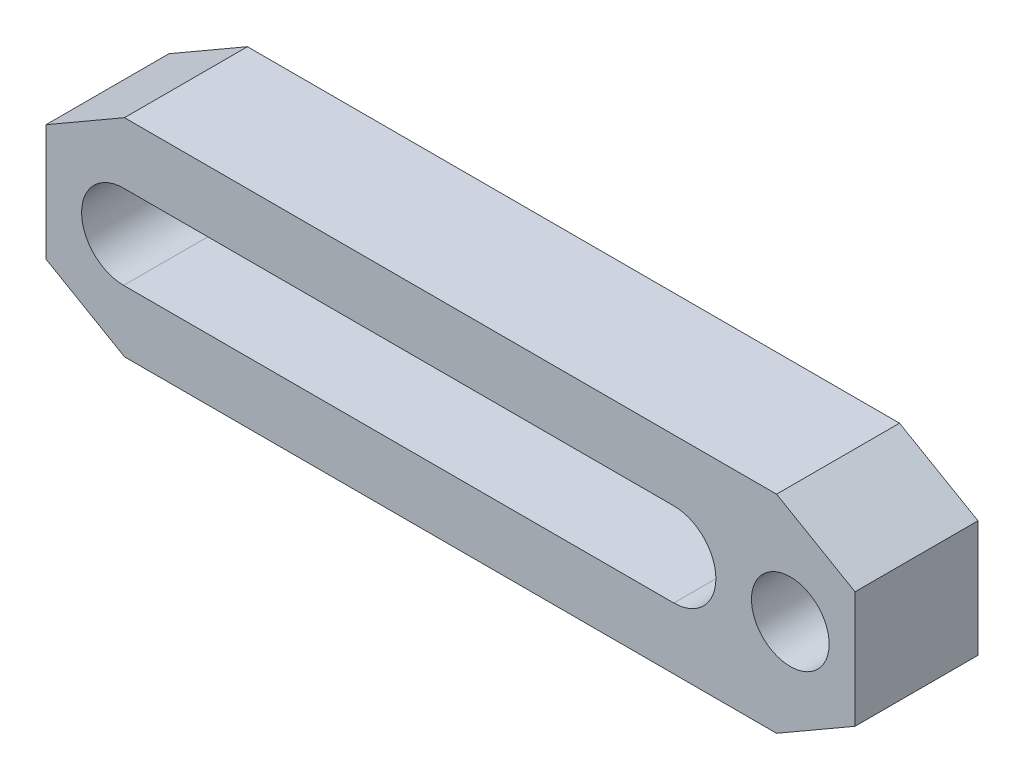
ISO-10303-21;
HEADER;
FILE_DESCRIPTION(('STEP AP214'),'2;1');
FILE_NAME('part.step','',(''),(''),'','','');
FILE_SCHEMA(('AUTOMOTIVE_DESIGN { 1 0 10303 214 1 1 1 1 }'));
ENDSEC;
DATA;
#1=APPLICATION_CONTEXT('core data for automotive mechanical design processes');
#2=APPLICATION_PROTOCOL_DEFINITION('international standard','automotive_design',2000,#1);
#3=PRODUCT_CONTEXT('',#1,'mechanical');
#4=PRODUCT('Part','Part','',(#3));
#5=PRODUCT_RELATED_PRODUCT_CATEGORY('part','',(#4));
#6=PRODUCT_DEFINITION_FORMATION('','',#4);
#7=PRODUCT_DEFINITION_CONTEXT('part definition',#1,'design');
#8=PRODUCT_DEFINITION('design','',#6,#7);
#9=PRODUCT_DEFINITION_SHAPE('','',#8);
#10=(LENGTH_UNIT() NAMED_UNIT(*) SI_UNIT(.MILLI.,.METRE.));
#11=(NAMED_UNIT(*) PLANE_ANGLE_UNIT() SI_UNIT($,.RADIAN.));
#12=(NAMED_UNIT(*) SI_UNIT($,.STERADIAN.) SOLID_ANGLE_UNIT());
#13=UNCERTAINTY_MEASURE_WITH_UNIT(LENGTH_MEASURE(1.E-05),#10,'distance_accuracy_value','');
#14=(GEOMETRIC_REPRESENTATION_CONTEXT(3) GLOBAL_UNCERTAINTY_ASSIGNED_CONTEXT((#13)) GLOBAL_UNIT_ASSIGNED_CONTEXT((#10,
#11,#12)) REPRESENTATION_CONTEXT('',''));
#15=CARTESIAN_POINT('',(0.,0.,0.));
#16=DIRECTION('',(0.,0.,1.));
#17=DIRECTION('',(1.,0.,0.));
#18=AXIS2_PLACEMENT_3D('',#15,#16,#17);
#19=CARTESIAN_POINT('',(-34.5,45.0843918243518,19.));
#20=DIRECTION('',(0.,0.,1.));
#21=DIRECTION('',(0.,1.,0.));
#22=AXIS2_PLACEMENT_3D('',#19,#20,#21);
#23=PLANE('',#22);
#24=CARTESIAN_POINT('',(18.,0.,19.));
#25=DIRECTION('',(0.,0.,1.));
#26=DIRECTION('',(0.,1.,0.));
#27=AXIS2_PLACEMENT_3D('',#24,#25,#26);
#28=CIRCLE('',#27,6.);
#29=CARTESIAN_POINT('',(18.,6.,19.));
#30=VERTEX_POINT('',#29);
#31=EDGE_CURVE('E124',#30,#30,#28,.T.);
#32=ORIENTED_EDGE('',*,*,#31,.F.);
#33=EDGE_LOOP('',(#32));
#34=FACE_BOUND('',#33,.T.);
#35=DIRECTION('',(-0.866025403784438,-0.5,0.));
#36=VECTOR('',#35,1.);
#37=CARTESIAN_POINT('',(-97.,9.,19.));
#38=LINE('',#37,#36);
#39=CARTESIAN_POINT('',(-84.8756443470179,16.,19.));
#40=VERTEX_POINT('',#39);
#41=CARTESIAN_POINT('',(-97.,9.,19.));
#42=VERTEX_POINT('',#41);
#43=EDGE_CURVE('E160',#40,#42,#38,.T.);
#44=ORIENTED_EDGE('',*,*,#43,.T.);
#45=DIRECTION('',(0.,-1.,0.));
#46=VECTOR('',#45,1.);
#47=CARTESIAN_POINT('',(-97.,-9.,19.));
#48=LINE('',#47,#46);
#49=CARTESIAN_POINT('',(-97.,-9.,19.));
#50=VERTEX_POINT('',#49);
#51=EDGE_CURVE('E163',#42,#50,#48,.T.);
#52=ORIENTED_EDGE('',*,*,#51,.T.);
#53=DIRECTION('',(0.866025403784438,-0.5,0.));
#54=VECTOR('',#53,1.);
#55=CARTESIAN_POINT('',(-97.,-9.,19.));
#56=LINE('',#55,#54);
#57=CARTESIAN_POINT('',(-84.8756443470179,-16.,19.));
#58=VERTEX_POINT('',#57);
#59=EDGE_CURVE('E165',#50,#58,#56,.T.);
#60=ORIENTED_EDGE('',*,*,#59,.T.);
#61=DIRECTION('',(1.,0.,0.));
#62=VECTOR('',#61,1.);
#63=CARTESIAN_POINT('',(15.8756443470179,-16.,19.));
#64=LINE('',#63,#62);
#65=CARTESIAN_POINT('',(15.8756443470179,-16.,19.));
#66=VERTEX_POINT('',#65);
#67=EDGE_CURVE('E167',#58,#66,#64,.T.);
#68=ORIENTED_EDGE('',*,*,#67,.T.);
#69=DIRECTION('',(0.866025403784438,0.5,0.));
#70=VECTOR('',#69,1.);
#71=CARTESIAN_POINT('',(28.,-9.,19.));
#72=LINE('',#71,#70);
#73=CARTESIAN_POINT('',(28.,-9.,19.));
#74=VERTEX_POINT('',#73);
#75=EDGE_CURVE('E169',#66,#74,#72,.T.);
#76=ORIENTED_EDGE('',*,*,#75,.T.);
#77=DIRECTION('',(0.,1.,0.));
#78=VECTOR('',#77,1.);
#79=CARTESIAN_POINT('',(28.,-9.,19.));
#80=LINE('',#79,#78);
#81=CARTESIAN_POINT('',(28.,9.,19.));
#82=VERTEX_POINT('',#81);
#83=EDGE_CURVE('E171',#74,#82,#80,.T.);
#84=ORIENTED_EDGE('',*,*,#83,.T.);
#85=DIRECTION('',(-0.866025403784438,0.5,0.));
#86=VECTOR('',#85,1.);
#87=CARTESIAN_POINT('',(28.,9.,19.));
#88=LINE('',#87,#86);
#89=CARTESIAN_POINT('',(15.8756443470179,16.,19.));
#90=VERTEX_POINT('',#89);
#91=EDGE_CURVE('E173',#82,#90,#88,.T.);
#92=ORIENTED_EDGE('',*,*,#91,.T.);
#93=DIRECTION('',(-1.,0.,0.));
#94=VECTOR('',#93,1.);
#95=CARTESIAN_POINT('',(15.8756443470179,16.,19.));
#96=LINE('',#95,#94);
#97=EDGE_CURVE('E175',#90,#40,#96,.T.);
#98=ORIENTED_EDGE('',*,*,#97,.T.);
#99=EDGE_LOOP('',(#44,#52,#60,#68,#76,#84,#92,#98));
#100=FACE_BOUND('',#99,.T.);
#101=DIRECTION('',(-1.,0.,0.));
#102=VECTOR('',#101,1.);
#103=CARTESIAN_POINT('',(0.,6.5,19.));
#104=LINE('',#103,#102);
#105=CARTESIAN_POINT('',(0.,6.5,19.));
#106=VERTEX_POINT('',#105);
#107=CARTESIAN_POINT('',(-85.,6.5,19.));
#108=VERTEX_POINT('',#107);
#109=EDGE_CURVE('E134',#106,#108,#104,.T.);
#110=ORIENTED_EDGE('',*,*,#109,.F.);
#111=CARTESIAN_POINT('',(0.,0.,19.));
#112=DIRECTION('',(0.,0.,1.));
#113=DIRECTION('',(0.,1.,0.));
#114=AXIS2_PLACEMENT_3D('',#111,#112,#113);
#115=CIRCLE('',#114,6.5);
#116=CARTESIAN_POINT('',(0.,-6.5,19.));
#117=VERTEX_POINT('',#116);
#118=EDGE_CURVE('E118',#117,#106,#115,.T.);
#119=ORIENTED_EDGE('',*,*,#118,.F.);
#120=DIRECTION('',(1.,0.,0.));
#121=VECTOR('',#120,1.);
#122=CARTESIAN_POINT('',(0.,-6.5,19.));
#123=LINE('',#122,#121);
#124=CARTESIAN_POINT('',(-85.,-6.5,19.));
#125=VERTEX_POINT('',#124);
#126=EDGE_CURVE('E138',#125,#117,#123,.T.);
#127=ORIENTED_EDGE('',*,*,#126,.F.);
#128=CARTESIAN_POINT('',(-85.,0.,19.));
#129=DIRECTION('',(0.,0.,1.));
#130=DIRECTION('',(0.,1.,0.));
#131=AXIS2_PLACEMENT_3D('',#128,#129,#130);
#132=CIRCLE('',#131,6.5);
#133=EDGE_CURVE('E136',#108,#125,#132,.T.);
#134=ORIENTED_EDGE('',*,*,#133,.F.);
#135=EDGE_LOOP('',(#110,#119,#127,#134));
#136=FACE_BOUND('',#135,.T.);
#137=ADVANCED_FACE('F14',(#34,#100,#136),#23,.T.);
#138=CARTESIAN_POINT('',(-34.5,45.0843918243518,0.));
#139=DIRECTION('',(0.,0.,1.));
#140=DIRECTION('',(0.,1.,0.));
#141=AXIS2_PLACEMENT_3D('',#138,#139,#140);
#142=PLANE('',#141);
#143=CARTESIAN_POINT('',(18.,0.,0.));
#144=DIRECTION('',(0.,0.,1.));
#145=DIRECTION('',(0.,1.,0.));
#146=AXIS2_PLACEMENT_3D('',#143,#144,#145);
#147=CIRCLE('',#146,6.);
#148=CARTESIAN_POINT('',(18.,6.,0.));
#149=VERTEX_POINT('',#148);
#150=EDGE_CURVE('E127',#149,#149,#147,.T.);
#151=ORIENTED_EDGE('',*,*,#150,.T.);
#152=EDGE_LOOP('',(#151));
#153=FACE_BOUND('',#152,.T.);
#154=DIRECTION('',(-0.866025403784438,-0.5,0.));
#155=VECTOR('',#154,1.);
#156=CARTESIAN_POINT('',(-97.,9.,0.));
#157=LINE('',#156,#155);
#158=CARTESIAN_POINT('',(-84.8756443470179,16.,0.));
#159=VERTEX_POINT('',#158);
#160=CARTESIAN_POINT('',(-97.,9.,0.));
#161=VERTEX_POINT('',#160);
#162=EDGE_CURVE('E119',#159,#161,#157,.T.);
#163=ORIENTED_EDGE('',*,*,#162,.F.);
#164=DIRECTION('',(-1.,0.,0.));
#165=VECTOR('',#164,1.);
#166=CARTESIAN_POINT('',(15.8756443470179,16.,0.));
#167=LINE('',#166,#165);
#168=CARTESIAN_POINT('',(15.8756443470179,16.,0.));
#169=VERTEX_POINT('',#168);
#170=EDGE_CURVE('E158',#169,#159,#167,.T.);
#171=ORIENTED_EDGE('',*,*,#170,.F.);
#172=DIRECTION('',(-0.866025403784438,0.5,0.));
#173=VECTOR('',#172,1.);
#174=CARTESIAN_POINT('',(28.,9.,0.));
#175=LINE('',#174,#173);
#176=CARTESIAN_POINT('',(28.,9.,0.));
#177=VERTEX_POINT('',#176);
#178=EDGE_CURVE('E156',#177,#169,#175,.T.);
#179=ORIENTED_EDGE('',*,*,#178,.F.);
#180=DIRECTION('',(0.,1.,0.));
#181=VECTOR('',#180,1.);
#182=CARTESIAN_POINT('',(28.,-9.,0.));
#183=LINE('',#182,#181);
#184=CARTESIAN_POINT('',(28.,-9.,0.));
#185=VERTEX_POINT('',#184);
#186=EDGE_CURVE('E154',#185,#177,#183,.T.);
#187=ORIENTED_EDGE('',*,*,#186,.F.);
#188=DIRECTION('',(0.866025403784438,0.5,0.));
#189=VECTOR('',#188,1.);
#190=CARTESIAN_POINT('',(28.,-9.,0.));
#191=LINE('',#190,#189);
#192=CARTESIAN_POINT('',(15.8756443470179,-16.,0.));
#193=VERTEX_POINT('',#192);
#194=EDGE_CURVE('E152',#193,#185,#191,.T.);
#195=ORIENTED_EDGE('',*,*,#194,.F.);
#196=DIRECTION('',(1.,0.,0.));
#197=VECTOR('',#196,1.);
#198=CARTESIAN_POINT('',(15.8756443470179,-16.,0.));
#199=LINE('',#198,#197);
#200=CARTESIAN_POINT('',(-84.8756443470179,-16.,0.));
#201=VERTEX_POINT('',#200);
#202=EDGE_CURVE('E150',#201,#193,#199,.T.);
#203=ORIENTED_EDGE('',*,*,#202,.F.);
#204=DIRECTION('',(0.866025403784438,-0.5,0.));
#205=VECTOR('',#204,1.);
#206=CARTESIAN_POINT('',(-97.,-9.,0.));
#207=LINE('',#206,#205);
#208=CARTESIAN_POINT('',(-97.,-9.,0.));
#209=VERTEX_POINT('',#208);
#210=EDGE_CURVE('E148',#209,#201,#207,.T.);
#211=ORIENTED_EDGE('',*,*,#210,.F.);
#212=DIRECTION('',(0.,-1.,0.));
#213=VECTOR('',#212,1.);
#214=CARTESIAN_POINT('',(-97.,-9.,0.));
#215=LINE('',#214,#213);
#216=EDGE_CURVE('E146',#161,#209,#215,.T.);
#217=ORIENTED_EDGE('',*,*,#216,.F.);
#218=EDGE_LOOP('',(#163,#171,#179,#187,#195,#203,#211,#217));
#219=FACE_BOUND('',#218,.T.);
#220=CARTESIAN_POINT('',(0.,0.,0.));
#221=DIRECTION('',(0.,0.,1.));
#222=DIRECTION('',(0.,1.,0.));
#223=AXIS2_PLACEMENT_3D('',#220,#221,#222);
#224=CIRCLE('',#223,6.5);
#225=CARTESIAN_POINT('',(0.,-6.5,0.));
#226=VERTEX_POINT('',#225);
#227=CARTESIAN_POINT('',(0.,6.5,0.));
#228=VERTEX_POINT('',#227);
#229=EDGE_CURVE('E37',#226,#228,#224,.T.);
#230=ORIENTED_EDGE('',*,*,#229,.T.);
#231=DIRECTION('',(-1.,0.,0.));
#232=VECTOR('',#231,1.);
#233=CARTESIAN_POINT('',(0.,6.5,0.));
#234=LINE('',#233,#232);
#235=CARTESIAN_POINT('',(-85.,6.5,0.));
#236=VERTEX_POINT('',#235);
#237=EDGE_CURVE('E105',#228,#236,#234,.T.);
#238=ORIENTED_EDGE('',*,*,#237,.T.);
#239=CARTESIAN_POINT('',(-85.,0.,0.));
#240=DIRECTION('',(0.,0.,1.));
#241=DIRECTION('',(0.,1.,0.));
#242=AXIS2_PLACEMENT_3D('',#239,#240,#241);
#243=CIRCLE('',#242,6.5);
#244=CARTESIAN_POINT('',(-85.,-6.5,0.));
#245=VERTEX_POINT('',#244);
#246=EDGE_CURVE('E114',#236,#245,#243,.T.);
#247=ORIENTED_EDGE('',*,*,#246,.T.);
#248=DIRECTION('',(1.,0.,0.));
#249=VECTOR('',#248,1.);
#250=CARTESIAN_POINT('',(0.,-6.5,0.));
#251=LINE('',#250,#249);
#252=EDGE_CURVE('E123',#245,#226,#251,.T.);
#253=ORIENTED_EDGE('',*,*,#252,.T.);
#254=EDGE_LOOP('',(#230,#238,#247,#253));
#255=FACE_BOUND('',#254,.T.);
#256=ADVANCED_FACE('F122',(#153,#219,#255),#142,.F.);
#257=CARTESIAN_POINT('',(-97.,9.,19.));
#258=DIRECTION('',(0.5,-0.866025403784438,0.));
#259=DIRECTION('',(0.866025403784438,0.5,0.));
#260=AXIS2_PLACEMENT_3D('',#257,#258,#259);
#261=PLANE('',#260);
#262=ORIENTED_EDGE('',*,*,#162,.T.);
#263=DIRECTION('',(0.,0.,-1.));
#264=VECTOR('',#263,1.);
#265=CARTESIAN_POINT('',(-97.,9.,19.));
#266=LINE('',#265,#264);
#267=EDGE_CURVE('E9',#42,#161,#266,.T.);
#268=ORIENTED_EDGE('',*,*,#267,.F.);
#269=ORIENTED_EDGE('',*,*,#43,.F.);
#270=DIRECTION('',(0.,0.,-1.));
#271=VECTOR('',#270,1.);
#272=CARTESIAN_POINT('',(-84.8756443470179,16.,19.));
#273=LINE('',#272,#271);
#274=EDGE_CURVE('E177',#40,#159,#273,.T.);
#275=ORIENTED_EDGE('',*,*,#274,.T.);
#276=EDGE_LOOP('',(#262,#268,#269,#275));
#277=FACE_BOUND('',#276,.T.);
#278=ADVANCED_FACE('F16',(#277),#261,.F.);
#279=CARTESIAN_POINT('',(-97.,-9.,19.));
#280=DIRECTION('',(1.,0.,0.));
#281=DIRECTION('',(0.,1.,0.));
#282=AXIS2_PLACEMENT_3D('',#279,#280,#281);
#283=PLANE('',#282);
#284=ORIENTED_EDGE('',*,*,#216,.T.);
#285=DIRECTION('',(0.,0.,-1.));
#286=VECTOR('',#285,1.);
#287=CARTESIAN_POINT('',(-97.,-9.,19.));
#288=LINE('',#287,#286);
#289=EDGE_CURVE('E22',#50,#209,#288,.T.);
#290=ORIENTED_EDGE('',*,*,#289,.F.);
#291=ORIENTED_EDGE('',*,*,#51,.F.);
#292=ORIENTED_EDGE('',*,*,#267,.T.);
#293=EDGE_LOOP('',(#284,#290,#291,#292));
#294=FACE_BOUND('',#293,.T.);
#295=ADVANCED_FACE('F221',(#294),#283,.F.);
#296=CARTESIAN_POINT('',(-97.,-9.,19.));
#297=DIRECTION('',(0.5,0.866025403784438,0.));
#298=DIRECTION('',(-0.866025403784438,0.5,0.));
#299=AXIS2_PLACEMENT_3D('',#296,#297,#298);
#300=PLANE('',#299);
#301=ORIENTED_EDGE('',*,*,#210,.T.);
#302=DIRECTION('',(0.,0.,-1.));
#303=VECTOR('',#302,1.);
#304=CARTESIAN_POINT('',(-84.8756443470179,-16.,19.));
#305=LINE('',#304,#303);
#306=EDGE_CURVE('E192',#58,#201,#305,.T.);
#307=ORIENTED_EDGE('',*,*,#306,.F.);
#308=ORIENTED_EDGE('',*,*,#59,.F.);
#309=ORIENTED_EDGE('',*,*,#289,.T.);
#310=EDGE_LOOP('',(#301,#307,#308,#309));
#311=FACE_BOUND('',#310,.T.);
#312=ADVANCED_FACE('F199',(#311),#300,.F.);
#313=CARTESIAN_POINT('',(15.8756443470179,-16.,19.));
#314=DIRECTION('',(0.,1.,0.));
#315=DIRECTION('',(-1.,0.,0.));
#316=AXIS2_PLACEMENT_3D('',#313,#314,#315);
#317=PLANE('',#316);
#318=ORIENTED_EDGE('',*,*,#202,.T.);
#319=DIRECTION('',(0.,0.,-1.));
#320=VECTOR('',#319,1.);
#321=CARTESIAN_POINT('',(15.8756443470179,-16.,19.));
#322=LINE('',#321,#320);
#323=EDGE_CURVE('E189',#66,#193,#322,.T.);
#324=ORIENTED_EDGE('',*,*,#323,.F.);
#325=ORIENTED_EDGE('',*,*,#67,.F.);
#326=ORIENTED_EDGE('',*,*,#306,.T.);
#327=EDGE_LOOP('',(#318,#324,#325,#326));
#328=FACE_BOUND('',#327,.T.);
#329=ADVANCED_FACE('F209',(#328),#317,.F.);
#330=CARTESIAN_POINT('',(28.,-9.,19.));
#331=DIRECTION('',(-0.5,0.866025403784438,0.));
#332=DIRECTION('',(-0.866025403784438,-0.5,0.));
#333=AXIS2_PLACEMENT_3D('',#330,#331,#332);
#334=PLANE('',#333);
#335=ORIENTED_EDGE('',*,*,#194,.T.);
#336=DIRECTION('',(0.,0.,-1.));
#337=VECTOR('',#336,1.);
#338=CARTESIAN_POINT('',(28.,-9.,19.));
#339=LINE('',#338,#337);
#340=EDGE_CURVE('E186',#74,#185,#339,.T.);
#341=ORIENTED_EDGE('',*,*,#340,.F.);
#342=ORIENTED_EDGE('',*,*,#75,.F.);
#343=ORIENTED_EDGE('',*,*,#323,.T.);
#344=EDGE_LOOP('',(#335,#341,#342,#343));
#345=FACE_BOUND('',#344,.T.);
#346=ADVANCED_FACE('F213',(#345),#334,.F.);
#347=CARTESIAN_POINT('',(28.,-9.,19.));
#348=DIRECTION('',(-1.,0.,0.));
#349=DIRECTION('',(0.,-1.,0.));
#350=AXIS2_PLACEMENT_3D('',#347,#348,#349);
#351=PLANE('',#350);
#352=ORIENTED_EDGE('',*,*,#186,.T.);
#353=DIRECTION('',(0.,0.,-1.));
#354=VECTOR('',#353,1.);
#355=CARTESIAN_POINT('',(28.,9.,19.));
#356=LINE('',#355,#354);
#357=EDGE_CURVE('E183',#82,#177,#356,.T.);
#358=ORIENTED_EDGE('',*,*,#357,.F.);
#359=ORIENTED_EDGE('',*,*,#83,.F.);
#360=ORIENTED_EDGE('',*,*,#340,.T.);
#361=EDGE_LOOP('',(#352,#358,#359,#360));
#362=FACE_BOUND('',#361,.T.);
#363=ADVANCED_FACE('F234',(#362),#351,.F.);
#364=CARTESIAN_POINT('',(28.,9.,19.));
#365=DIRECTION('',(-0.5,-0.866025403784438,0.));
#366=DIRECTION('',(0.866025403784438,-0.5,0.));
#367=AXIS2_PLACEMENT_3D('',#364,#365,#366);
#368=PLANE('',#367);
#369=ORIENTED_EDGE('',*,*,#178,.T.);
#370=DIRECTION('',(0.,0.,-1.));
#371=VECTOR('',#370,1.);
#372=CARTESIAN_POINT('',(15.8756443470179,16.,19.));
#373=LINE('',#372,#371);
#374=EDGE_CURVE('E180',#90,#169,#373,.T.);
#375=ORIENTED_EDGE('',*,*,#374,.F.);
#376=ORIENTED_EDGE('',*,*,#91,.F.);
#377=ORIENTED_EDGE('',*,*,#357,.T.);
#378=EDGE_LOOP('',(#369,#375,#376,#377));
#379=FACE_BOUND('',#378,.T.);
#380=ADVANCED_FACE('F232',(#379),#368,.F.);
#381=CARTESIAN_POINT('',(15.8756443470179,16.,19.));
#382=DIRECTION('',(0.,-1.,0.));
#383=DIRECTION('',(1.,0.,0.));
#384=AXIS2_PLACEMENT_3D('',#381,#382,#383);
#385=PLANE('',#384);
#386=ORIENTED_EDGE('',*,*,#170,.T.);
#387=ORIENTED_EDGE('',*,*,#274,.F.);
#388=ORIENTED_EDGE('',*,*,#97,.F.);
#389=ORIENTED_EDGE('',*,*,#374,.T.);
#390=EDGE_LOOP('',(#386,#387,#388,#389));
#391=FACE_BOUND('',#390,.T.);
#392=ADVANCED_FACE('F227',(#391),#385,.F.);
#393=CARTESIAN_POINT('',(0.,0.,19.));
#394=DIRECTION('',(0.,0.,-1.));
#395=DIRECTION('',(0.,-1.,0.));
#396=AXIS2_PLACEMENT_3D('',#393,#394,#395);
#397=CYLINDRICAL_SURFACE('',#396,6.5);
#398=ORIENTED_EDGE('',*,*,#229,.F.);
#399=DIRECTION('',(0.,0.,-1.));
#400=VECTOR('',#399,1.);
#401=CARTESIAN_POINT('',(0.,-6.5,19.));
#402=LINE('',#401,#400);
#403=EDGE_CURVE('E140',#117,#226,#402,.T.);
#404=ORIENTED_EDGE('',*,*,#403,.F.);
#405=ORIENTED_EDGE('',*,*,#118,.T.);
#406=DIRECTION('',(0.,0.,-1.));
#407=VECTOR('',#406,1.);
#408=CARTESIAN_POINT('',(0.,6.5,19.));
#409=LINE('',#408,#407);
#410=EDGE_CURVE('E107',#106,#228,#409,.T.);
#411=ORIENTED_EDGE('',*,*,#410,.T.);
#412=EDGE_LOOP('',(#398,#404,#405,#411));
#413=FACE_BOUND('',#412,.T.);
#414=ADVANCED_FACE('F116',(#413),#397,.F.);
#415=CARTESIAN_POINT('',(0.,6.5,19.));
#416=DIRECTION('',(0.,-1.,0.));
#417=DIRECTION('',(1.,0.,0.));
#418=AXIS2_PLACEMENT_3D('',#415,#416,#417);
#419=PLANE('',#418);
#420=ORIENTED_EDGE('',*,*,#237,.F.);
#421=ORIENTED_EDGE('',*,*,#410,.F.);
#422=ORIENTED_EDGE('',*,*,#109,.T.);
#423=DIRECTION('',(0.,0.,-1.));
#424=VECTOR('',#423,1.);
#425=CARTESIAN_POINT('',(-85.,6.5,19.));
#426=LINE('',#425,#424);
#427=EDGE_CURVE('E110',#108,#236,#426,.T.);
#428=ORIENTED_EDGE('',*,*,#427,.T.);
#429=EDGE_LOOP('',(#420,#421,#422,#428));
#430=FACE_BOUND('',#429,.T.);
#431=ADVANCED_FACE('F106',(#430),#419,.T.);
#432=CARTESIAN_POINT('',(-85.,0.,19.));
#433=DIRECTION('',(0.,0.,-1.));
#434=DIRECTION('',(0.,-1.,0.));
#435=AXIS2_PLACEMENT_3D('',#432,#433,#434);
#436=CYLINDRICAL_SURFACE('',#435,6.5);
#437=ORIENTED_EDGE('',*,*,#246,.F.);
#438=ORIENTED_EDGE('',*,*,#427,.F.);
#439=ORIENTED_EDGE('',*,*,#133,.T.);
#440=DIRECTION('',(0.,0.,-1.));
#441=VECTOR('',#440,1.);
#442=CARTESIAN_POINT('',(-85.,-6.5,19.));
#443=LINE('',#442,#441);
#444=EDGE_CURVE('E29',#125,#245,#443,.T.);
#445=ORIENTED_EDGE('',*,*,#444,.T.);
#446=EDGE_LOOP('',(#437,#438,#439,#445));
#447=FACE_BOUND('',#446,.T.);
#448=ADVANCED_FACE('F262',(#447),#436,.F.);
#449=CARTESIAN_POINT('',(0.,-6.5,19.));
#450=DIRECTION('',(0.,1.,0.));
#451=DIRECTION('',(-1.,0.,0.));
#452=AXIS2_PLACEMENT_3D('',#449,#450,#451);
#453=PLANE('',#452);
#454=ORIENTED_EDGE('',*,*,#252,.F.);
#455=ORIENTED_EDGE('',*,*,#444,.F.);
#456=ORIENTED_EDGE('',*,*,#126,.T.);
#457=ORIENTED_EDGE('',*,*,#403,.T.);
#458=EDGE_LOOP('',(#454,#455,#456,#457));
#459=FACE_BOUND('',#458,.T.);
#460=ADVANCED_FACE('F267',(#459),#453,.T.);
#461=CARTESIAN_POINT('',(18.,0.,19.));
#462=DIRECTION('',(0.,0.,1.));
#463=DIRECTION('',(0.,1.,0.));
#464=AXIS2_PLACEMENT_3D('',#461,#462,#463);
#465=CYLINDRICAL_SURFACE('',#464,6.);
#466=ORIENTED_EDGE('',*,*,#150,.F.);
#467=EDGE_LOOP('',(#466));
#468=FACE_BOUND('',#467,.T.);
#469=ORIENTED_EDGE('',*,*,#31,.T.);
#470=EDGE_LOOP('',(#469));
#471=FACE_BOUND('',#470,.T.);
#472=ADVANCED_FACE('F271',(#468,#471),#465,.F.);
#473=CLOSED_SHELL('',(#137,#256,#278,#295,#312,#329,#346,#363,#380,#392,#414,#431,#448,#460,#472));
#474=MANIFOLD_SOLID_BREP('B1',#473);
#475=ADVANCED_BREP_SHAPE_REPRESENTATION('',(#18,#474),#14);
#476=SHAPE_DEFINITION_REPRESENTATION(#9,#475);
ENDSEC;
END-ISO-10303-21;
